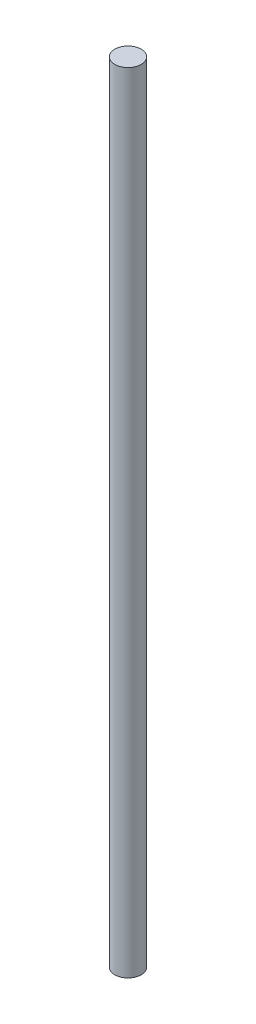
ISO-10303-21;
HEADER;
FILE_DESCRIPTION(('STEP AP214'),'2;1');
FILE_NAME('part.step','',(''),(''),'','','');
FILE_SCHEMA(('AUTOMOTIVE_DESIGN { 1 0 10303 214 1 1 1 1 }'));
ENDSEC;
DATA;
#1=APPLICATION_CONTEXT('core data for automotive mechanical design processes');
#2=APPLICATION_PROTOCOL_DEFINITION('international standard','automotive_design',2000,#1);
#3=PRODUCT_CONTEXT('',#1,'mechanical');
#4=PRODUCT('Part','Part','',(#3));
#5=PRODUCT_RELATED_PRODUCT_CATEGORY('part','',(#4));
#6=PRODUCT_DEFINITION_FORMATION('','',#4);
#7=PRODUCT_DEFINITION_CONTEXT('part definition',#1,'design');
#8=PRODUCT_DEFINITION('design','',#6,#7);
#9=PRODUCT_DEFINITION_SHAPE('','',#8);
#10=(LENGTH_UNIT() NAMED_UNIT(*) SI_UNIT(.MILLI.,.METRE.));
#11=(NAMED_UNIT(*) PLANE_ANGLE_UNIT() SI_UNIT($,.RADIAN.));
#12=(NAMED_UNIT(*) SI_UNIT($,.STERADIAN.) SOLID_ANGLE_UNIT());
#13=UNCERTAINTY_MEASURE_WITH_UNIT(LENGTH_MEASURE(1.E-05),#10,'distance_accuracy_value','');
#14=(GEOMETRIC_REPRESENTATION_CONTEXT(3) GLOBAL_UNCERTAINTY_ASSIGNED_CONTEXT((#13)) GLOBAL_UNIT_ASSIGNED_CONTEXT((#10,
#11,#12)) REPRESENTATION_CONTEXT('',''));
#15=CARTESIAN_POINT('',(0.,0.,0.));
#16=DIRECTION('',(0.,0.,1.));
#17=DIRECTION('',(1.,0.,0.));
#18=AXIS2_PLACEMENT_3D('',#15,#16,#17);
#19=CARTESIAN_POINT('',(0.,1422.4,0.));
#20=DIRECTION('',(0.,-1.,0.));
#21=DIRECTION('',(0.,0.,-1.));
#22=AXIS2_PLACEMENT_3D('',#19,#20,#21);
#23=CYLINDRICAL_SURFACE('',#22,23.8125);
#24=CARTESIAN_POINT('',(0.,1422.4,0.));
#25=DIRECTION('',(0.,1.,0.));
#26=DIRECTION('',(0.,0.,1.));
#27=AXIS2_PLACEMENT_3D('',#24,#25,#26);
#28=CIRCLE('',#27,23.8125);
#29=CARTESIAN_POINT('',(0.,1422.4,23.8125));
#30=VERTEX_POINT('',#29);
#31=EDGE_CURVE('E10',#30,#30,#28,.T.);
#32=ORIENTED_EDGE('',*,*,#31,.F.);
#33=EDGE_LOOP('',(#32));
#34=FACE_BOUND('',#33,.T.);
#35=CARTESIAN_POINT('',(0.,0.,0.));
#36=DIRECTION('',(0.,1.,0.));
#37=DIRECTION('',(0.,0.,1.));
#38=AXIS2_PLACEMENT_3D('',#35,#36,#37);
#39=CIRCLE('',#38,23.8125);
#40=CARTESIAN_POINT('',(0.,0.,23.8125));
#41=VERTEX_POINT('',#40);
#42=EDGE_CURVE('E32',#41,#41,#39,.T.);
#43=ORIENTED_EDGE('',*,*,#42,.T.);
#44=EDGE_LOOP('',(#43));
#45=FACE_BOUND('',#44,.T.);
#46=ADVANCED_FACE('F29',(#34,#45),#23,.T.);
#47=CARTESIAN_POINT('',(0.,1422.4,0.));
#48=DIRECTION('',(0.,1.,0.));
#49=DIRECTION('',(0.,0.,1.));
#50=AXIS2_PLACEMENT_3D('',#47,#48,#49);
#51=PLANE('',#50);
#52=ORIENTED_EDGE('',*,*,#31,.T.);
#53=EDGE_LOOP('',(#52));
#54=FACE_BOUND('',#53,.T.);
#55=ADVANCED_FACE('F44',(#54),#51,.T.);
#56=CARTESIAN_POINT('',(0.,0.,0.));
#57=DIRECTION('',(0.,1.,0.));
#58=DIRECTION('',(0.,0.,1.));
#59=AXIS2_PLACEMENT_3D('',#56,#57,#58);
#60=PLANE('',#59);
#61=ORIENTED_EDGE('',*,*,#42,.F.);
#62=EDGE_LOOP('',(#61));
#63=FACE_BOUND('',#62,.T.);
#64=ADVANCED_FACE('F42',(#63),#60,.F.);
#65=CLOSED_SHELL('',(#46,#55,#64));
#66=MANIFOLD_SOLID_BREP('B2',#65);
#67=ADVANCED_BREP_SHAPE_REPRESENTATION('',(#18,#66),#14);
#68=SHAPE_DEFINITION_REPRESENTATION(#9,#67);
ENDSEC;
END-ISO-10303-21;
